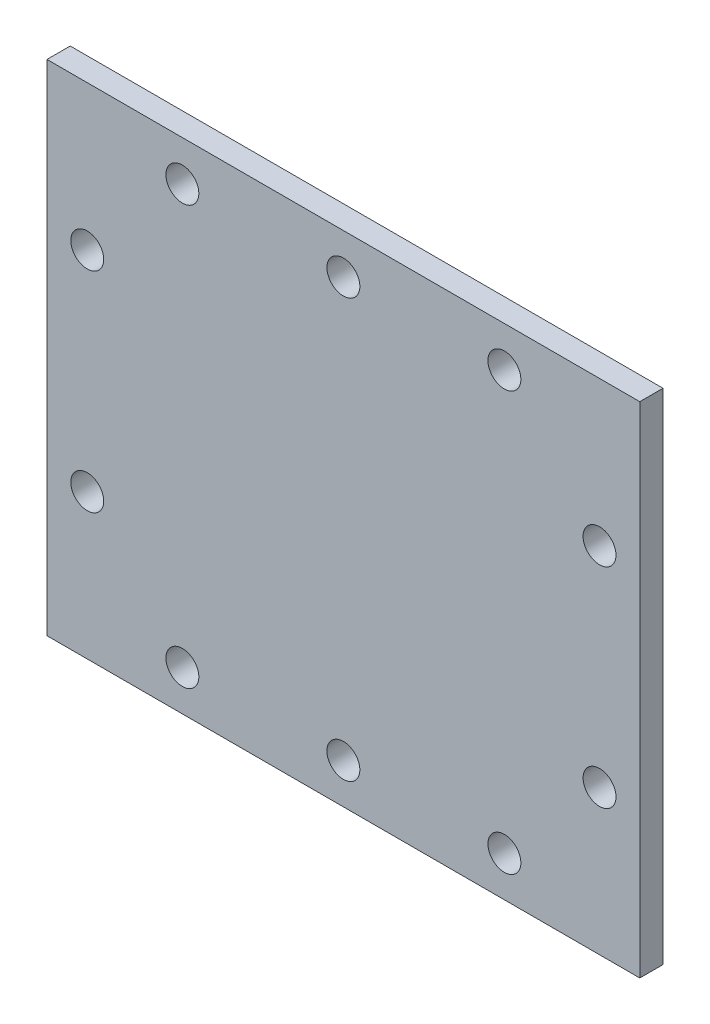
from build123d import *

# Parameters (mm, degrees)
SKETCH1_W                  = 81
SKETCH1_H                  = 68.2
WINDOW_POLYCARBONATE_DEPTH = 3.175
F_10X_CLEARANCE_HOLE_M4_D  = 4.5


with BuildPart() as part:
    # Sketch1 → Window_ Polycarbonate (new body)
    with BuildSketch(Plane.XY):
        with Locations((40.5, 34.1)):
            Rectangle(SKETCH1_W, SKETCH1_H)
    extrude(amount=WINDOW_POLYCARBONATE_DEPTH)

    # 10X_ Clearance Hole_ M4 (through all)
    with Locations(Plane.XY.offset(3.175)):
        with Locations((40.5, 5.5), (62.5, 5.5), (18.5, 5.5), (5.5, 19.8), (5.5, 48.4), (18.5, 62.7), (62.5, 62.7), (75.5, 48.4), (75.5, 19.8), (-14.096993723, 58.717542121), (40.5, 62.7), (-22.097522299, 69.695011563)):
            Hole(F_10X_CLEARANCE_HOLE_M4_D / 2)


solid = part.part
